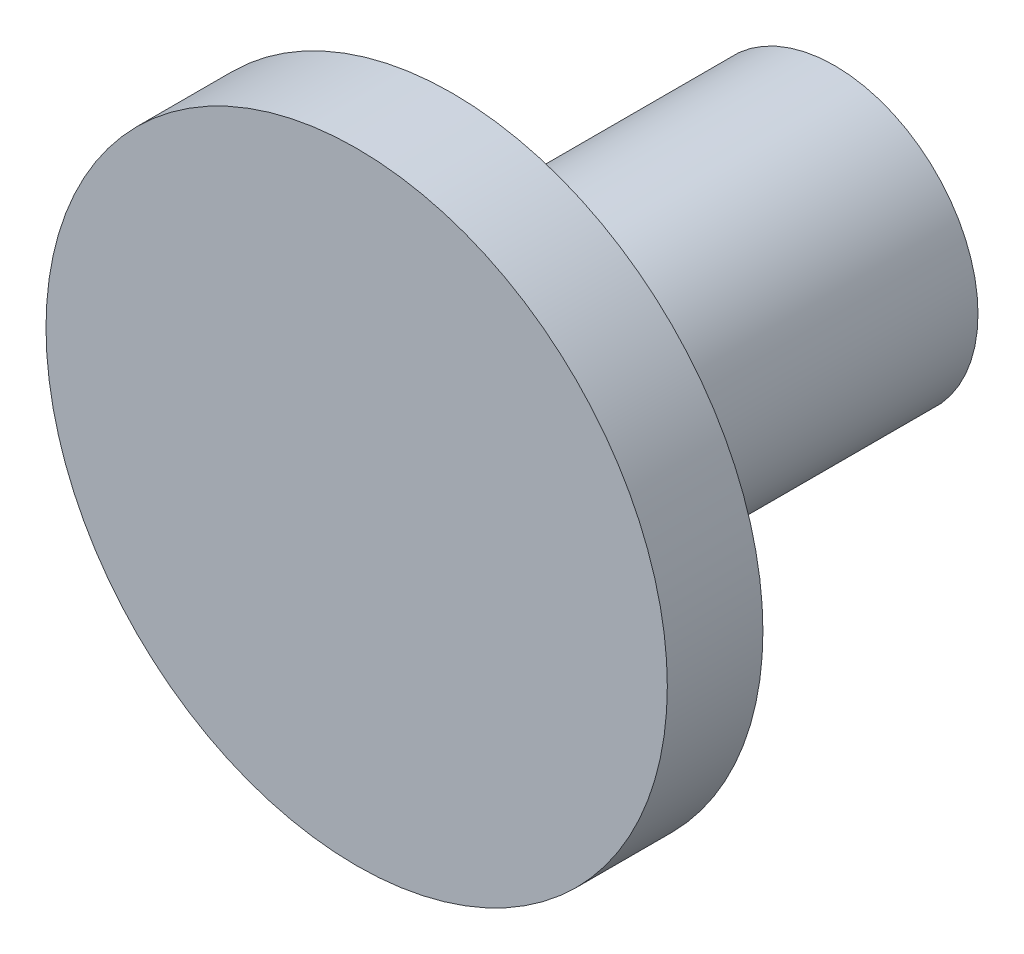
from build123d import *

# Parameters (mm, degrees)
ESQUISSE2_R      = 1.5
EXTRUSION1_DEPTH = 4
ESQUISSE3_R      = 3.25
EXTRUSION2_DEPTH = 1


with BuildPart() as part:
    # Esquisse2 → Extrusion1 (new body)
    with BuildSketch(Plane.XY):
        with Locations((19, 0)):
            Circle(ESQUISSE2_R)
    extrude(amount=-EXTRUSION1_DEPTH)

    # Esquisse3 → Extrusion2 (add)
    with BuildSketch(Plane.XY):
        with Locations((19, 0)):
            Circle(ESQUISSE3_R)
    extrude(amount=EXTRUSION2_DEPTH)


solid = part.part
